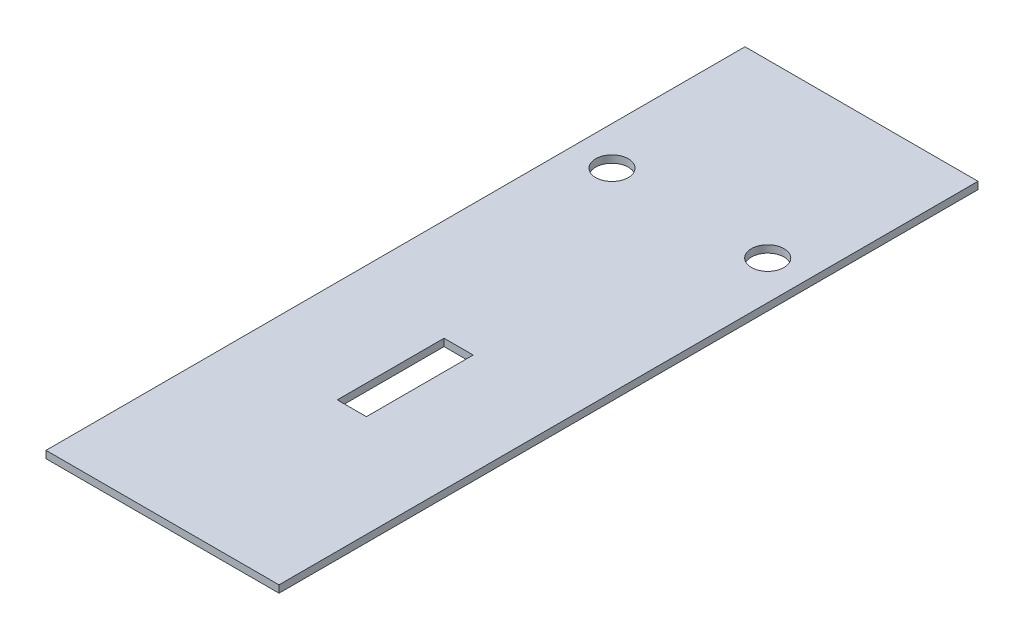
ISO-10303-21;
HEADER;
FILE_DESCRIPTION(('STEP AP214'),'2;1');
FILE_NAME('part.step','',(''),(''),'','','');
FILE_SCHEMA(('AUTOMOTIVE_DESIGN { 1 0 10303 214 1 1 1 1 }'));
ENDSEC;
DATA;
#1=APPLICATION_CONTEXT('core data for automotive mechanical design processes');
#2=APPLICATION_PROTOCOL_DEFINITION('international standard','automotive_design',2000,#1);
#3=PRODUCT_CONTEXT('',#1,'mechanical');
#4=PRODUCT('Part','Part','',(#3));
#5=PRODUCT_RELATED_PRODUCT_CATEGORY('part','',(#4));
#6=PRODUCT_DEFINITION_FORMATION('','',#4);
#7=PRODUCT_DEFINITION_CONTEXT('part definition',#1,'design');
#8=PRODUCT_DEFINITION('design','',#6,#7);
#9=PRODUCT_DEFINITION_SHAPE('','',#8);
#10=(LENGTH_UNIT() NAMED_UNIT(*) SI_UNIT(.MILLI.,.METRE.));
#11=(NAMED_UNIT(*) PLANE_ANGLE_UNIT() SI_UNIT($,.RADIAN.));
#12=(NAMED_UNIT(*) SI_UNIT($,.STERADIAN.) SOLID_ANGLE_UNIT());
#13=UNCERTAINTY_MEASURE_WITH_UNIT(LENGTH_MEASURE(1.E-05),#10,'distance_accuracy_value','');
#14=(GEOMETRIC_REPRESENTATION_CONTEXT(3) GLOBAL_UNCERTAINTY_ASSIGNED_CONTEXT((#13)) GLOBAL_UNIT_ASSIGNED_CONTEXT((#10,
#11,#12)) REPRESENTATION_CONTEXT('',''));
#15=CARTESIAN_POINT('',(0.,0.,0.));
#16=DIRECTION('',(0.,0.,1.));
#17=DIRECTION('',(1.,0.,0.));
#18=AXIS2_PLACEMENT_3D('',#15,#16,#17);
#19=CARTESIAN_POINT('',(76.2,4.7625,228.6));
#20=DIRECTION('',(-1.,0.,0.));
#21=DIRECTION('',(0.,0.,1.));
#22=AXIS2_PLACEMENT_3D('',#19,#20,#21);
#23=PLANE('',#22);
#24=DIRECTION('',(0.,0.,-1.));
#25=VECTOR('',#24,1.);
#26=CARTESIAN_POINT('',(76.2,0.,228.6));
#27=LINE('',#26,#25);
#28=CARTESIAN_POINT('',(76.2,0.,228.6));
#29=VERTEX_POINT('',#28);
#30=CARTESIAN_POINT('',(76.2,0.,-228.6));
#31=VERTEX_POINT('',#30);
#32=EDGE_CURVE('E126',#29,#31,#27,.T.);
#33=ORIENTED_EDGE('',*,*,#32,.T.);
#34=DIRECTION('',(0.,-1.,0.));
#35=VECTOR('',#34,1.);
#36=CARTESIAN_POINT('',(76.2,4.7625,-228.6));
#37=LINE('',#36,#35);
#38=CARTESIAN_POINT('',(76.2,4.7625,-228.6));
#39=VERTEX_POINT('',#38);
#40=EDGE_CURVE('E11',#39,#31,#37,.T.);
#41=ORIENTED_EDGE('',*,*,#40,.F.);
#42=DIRECTION('',(0.,0.,-1.));
#43=VECTOR('',#42,1.);
#44=CARTESIAN_POINT('',(76.2,4.7625,228.6));
#45=LINE('',#44,#43);
#46=CARTESIAN_POINT('',(76.2,4.7625,228.6));
#47=VERTEX_POINT('',#46);
#48=EDGE_CURVE('E174',#47,#39,#45,.T.);
#49=ORIENTED_EDGE('',*,*,#48,.F.);
#50=DIRECTION('',(0.,-1.,0.));
#51=VECTOR('',#50,1.);
#52=CARTESIAN_POINT('',(76.2,4.7625,228.6));
#53=LINE('',#52,#51);
#54=EDGE_CURVE('E188',#47,#29,#53,.T.);
#55=ORIENTED_EDGE('',*,*,#54,.T.);
#56=EDGE_LOOP('',(#33,#41,#49,#55));
#57=FACE_BOUND('',#56,.T.);
#58=ADVANCED_FACE('F43',(#57),#23,.F.);
#59=CARTESIAN_POINT('',(-76.2,4.7625,-228.6));
#60=DIRECTION('',(0.,0.,1.));
#61=DIRECTION('',(1.,0.,0.));
#62=AXIS2_PLACEMENT_3D('',#59,#60,#61);
#63=PLANE('',#62);
#64=DIRECTION('',(-1.,0.,0.));
#65=VECTOR('',#64,1.);
#66=CARTESIAN_POINT('',(-76.2,0.,-228.6));
#67=LINE('',#66,#65);
#68=CARTESIAN_POINT('',(-76.2,0.,-228.6));
#69=VERTEX_POINT('',#68);
#70=EDGE_CURVE('E192',#31,#69,#67,.T.);
#71=ORIENTED_EDGE('',*,*,#70,.T.);
#72=DIRECTION('',(0.,-1.,0.));
#73=VECTOR('',#72,1.);
#74=CARTESIAN_POINT('',(-76.2,4.7625,-228.6));
#75=LINE('',#74,#73);
#76=CARTESIAN_POINT('',(-76.2,4.7625,-228.6));
#77=VERTEX_POINT('',#76);
#78=EDGE_CURVE('E51',#77,#69,#75,.T.);
#79=ORIENTED_EDGE('',*,*,#78,.F.);
#80=DIRECTION('',(-1.,0.,0.));
#81=VECTOR('',#80,1.);
#82=CARTESIAN_POINT('',(-76.2,4.7625,-228.6));
#83=LINE('',#82,#81);
#84=EDGE_CURVE('E178',#39,#77,#83,.T.);
#85=ORIENTED_EDGE('',*,*,#84,.F.);
#86=ORIENTED_EDGE('',*,*,#40,.T.);
#87=EDGE_LOOP('',(#71,#79,#85,#86));
#88=FACE_BOUND('',#87,.T.);
#89=ADVANCED_FACE('F227',(#88),#63,.F.);
#90=CARTESIAN_POINT('',(-76.2,4.7625,228.6));
#91=DIRECTION('',(1.,0.,0.));
#92=DIRECTION('',(0.,0.,-1.));
#93=AXIS2_PLACEMENT_3D('',#90,#91,#92);
#94=PLANE('',#93);
#95=DIRECTION('',(0.,0.,1.));
#96=VECTOR('',#95,1.);
#97=CARTESIAN_POINT('',(-76.2,0.,228.6));
#98=LINE('',#97,#96);
#99=CARTESIAN_POINT('',(-76.2,0.,228.6));
#100=VERTEX_POINT('',#99);
#101=EDGE_CURVE('E195',#69,#100,#98,.T.);
#102=ORIENTED_EDGE('',*,*,#101,.T.);
#103=DIRECTION('',(0.,-1.,0.));
#104=VECTOR('',#103,1.);
#105=CARTESIAN_POINT('',(-76.2,4.7625,228.6));
#106=LINE('',#105,#104);
#107=CARTESIAN_POINT('',(-76.2,4.7625,228.6));
#108=VERTEX_POINT('',#107);
#109=EDGE_CURVE('E203',#108,#100,#106,.T.);
#110=ORIENTED_EDGE('',*,*,#109,.F.);
#111=DIRECTION('',(0.,0.,1.));
#112=VECTOR('',#111,1.);
#113=CARTESIAN_POINT('',(-76.2,4.7625,228.6));
#114=LINE('',#113,#112);
#115=EDGE_CURVE('E182',#77,#108,#114,.T.);
#116=ORIENTED_EDGE('',*,*,#115,.F.);
#117=ORIENTED_EDGE('',*,*,#78,.T.);
#118=EDGE_LOOP('',(#102,#110,#116,#117));
#119=FACE_BOUND('',#118,.T.);
#120=ADVANCED_FACE('F212',(#119),#94,.F.);
#121=CARTESIAN_POINT('',(-76.2,4.7625,228.6));
#122=DIRECTION('',(0.,0.,-1.));
#123=DIRECTION('',(-1.,0.,0.));
#124=AXIS2_PLACEMENT_3D('',#121,#122,#123);
#125=PLANE('',#124);
#126=DIRECTION('',(1.,0.,0.));
#127=VECTOR('',#126,1.);
#128=CARTESIAN_POINT('',(-76.2,0.,228.6));
#129=LINE('',#128,#127);
#130=EDGE_CURVE('E179',#100,#29,#129,.T.);
#131=ORIENTED_EDGE('',*,*,#130,.T.);
#132=ORIENTED_EDGE('',*,*,#54,.F.);
#133=DIRECTION('',(1.,0.,0.));
#134=VECTOR('',#133,1.);
#135=CARTESIAN_POINT('',(-76.2,4.7625,228.6));
#136=LINE('',#135,#134);
#137=EDGE_CURVE('E185',#108,#47,#136,.T.);
#138=ORIENTED_EDGE('',*,*,#137,.F.);
#139=ORIENTED_EDGE('',*,*,#109,.T.);
#140=EDGE_LOOP('',(#131,#132,#138,#139));
#141=FACE_BOUND('',#140,.T.);
#142=ADVANCED_FACE('F221',(#141),#125,.F.);
#143=CARTESIAN_POINT('',(0.,4.7625,0.));
#144=DIRECTION('',(0.,-1.,0.));
#145=DIRECTION('',(0.,0.,-1.));
#146=AXIS2_PLACEMENT_3D('',#143,#144,#145);
#147=PLANE('',#146);
#148=DIRECTION('',(0.,0.,1.));
#149=VECTOR('',#148,1.);
#150=CARTESIAN_POINT('',(-9.525,4.7625,34.9250000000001));
#151=LINE('',#150,#149);
#152=CARTESIAN_POINT('',(-9.525,4.7625,34.9250000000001));
#153=VERTEX_POINT('',#152);
#154=CARTESIAN_POINT('',(-9.52499999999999,4.7625,104.775));
#155=VERTEX_POINT('',#154);
#156=EDGE_CURVE('E108',#153,#155,#151,.T.);
#157=ORIENTED_EDGE('',*,*,#156,.F.);
#158=DIRECTION('',(-1.,0.,0.));
#159=VECTOR('',#158,1.);
#160=CARTESIAN_POINT('',(-9.525,4.7625,34.9250000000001));
#161=LINE('',#160,#159);
#162=CARTESIAN_POINT('',(9.525,4.7625,34.9250000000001));
#163=VERTEX_POINT('',#162);
#164=EDGE_CURVE('E136',#163,#153,#161,.T.);
#165=ORIENTED_EDGE('',*,*,#164,.F.);
#166=DIRECTION('',(0.,0.,-1.));
#167=VECTOR('',#166,1.);
#168=CARTESIAN_POINT('',(9.525,4.7625,34.9250000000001));
#169=LINE('',#168,#167);
#170=CARTESIAN_POINT('',(9.52500000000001,4.7625,104.775));
#171=VERTEX_POINT('',#170);
#172=EDGE_CURVE('E132',#171,#163,#169,.T.);
#173=ORIENTED_EDGE('',*,*,#172,.F.);
#174=DIRECTION('',(1.,0.,0.));
#175=VECTOR('',#174,1.);
#176=CARTESIAN_POINT('',(-9.52499999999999,4.7625,104.775));
#177=LINE('',#176,#175);
#178=EDGE_CURVE('E117',#155,#171,#177,.T.);
#179=ORIENTED_EDGE('',*,*,#178,.F.);
#180=EDGE_LOOP('',(#157,#165,#173,#179));
#181=FACE_BOUND('',#180,.T.);
#182=CARTESIAN_POINT('',(-50.927,4.7625,-116.332));
#183=DIRECTION('',(0.,1.,0.));
#184=DIRECTION('',(0.,0.,1.));
#185=AXIS2_PLACEMENT_3D('',#182,#183,#184);
#186=CIRCLE('',#185,10.668);
#187=CARTESIAN_POINT('',(-50.927,4.7625,-127.));
#188=VERTEX_POINT('',#187);
#189=EDGE_CURVE('E162',#188,#188,#186,.T.);
#190=ORIENTED_EDGE('',*,*,#189,.F.);
#191=EDGE_LOOP('',(#190));
#192=FACE_BOUND('',#191,.T.);
#193=CARTESIAN_POINT('',(50.927,4.7625,-116.332));
#194=DIRECTION('',(0.,1.,0.));
#195=DIRECTION('',(0.,0.,1.));
#196=AXIS2_PLACEMENT_3D('',#193,#194,#195);
#197=CIRCLE('',#196,10.668);
#198=CARTESIAN_POINT('',(50.927,4.7625,-127.));
#199=VERTEX_POINT('',#198);
#200=EDGE_CURVE('E170',#199,#199,#197,.T.);
#201=ORIENTED_EDGE('',*,*,#200,.F.);
#202=EDGE_LOOP('',(#201));
#203=FACE_BOUND('',#202,.T.);
#204=ORIENTED_EDGE('',*,*,#48,.T.);
#205=ORIENTED_EDGE('',*,*,#84,.T.);
#206=ORIENTED_EDGE('',*,*,#115,.T.);
#207=ORIENTED_EDGE('',*,*,#137,.T.);
#208=EDGE_LOOP('',(#204,#205,#206,#207));
#209=FACE_BOUND('',#208,.T.);
#210=ADVANCED_FACE('F130',(#181,#192,#203,#209),#147,.F.);
#211=CARTESIAN_POINT('',(0.,0.,0.));
#212=DIRECTION('',(0.,-1.,0.));
#213=DIRECTION('',(0.,0.,-1.));
#214=AXIS2_PLACEMENT_3D('',#211,#212,#213);
#215=PLANE('',#214);
#216=DIRECTION('',(-1.,0.,0.));
#217=VECTOR('',#216,1.);
#218=CARTESIAN_POINT('',(-9.525,0.,34.9250000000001));
#219=LINE('',#218,#217);
#220=CARTESIAN_POINT('',(9.525,0.,34.9250000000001));
#221=VERTEX_POINT('',#220);
#222=CARTESIAN_POINT('',(-9.525,0.,34.9250000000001));
#223=VERTEX_POINT('',#222);
#224=EDGE_CURVE('E118',#221,#223,#219,.T.);
#225=ORIENTED_EDGE('',*,*,#224,.T.);
#226=DIRECTION('',(0.,0.,1.));
#227=VECTOR('',#226,1.);
#228=CARTESIAN_POINT('',(-9.525,0.,34.9250000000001));
#229=LINE('',#228,#227);
#230=CARTESIAN_POINT('',(-9.52499999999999,0.,104.775));
#231=VERTEX_POINT('',#230);
#232=EDGE_CURVE('E66',#223,#231,#229,.T.);
#233=ORIENTED_EDGE('',*,*,#232,.T.);
#234=DIRECTION('',(1.,0.,0.));
#235=VECTOR('',#234,1.);
#236=CARTESIAN_POINT('',(-9.52499999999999,0.,104.775));
#237=LINE('',#236,#235);
#238=CARTESIAN_POINT('',(9.52500000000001,0.,104.775));
#239=VERTEX_POINT('',#238);
#240=EDGE_CURVE('E124',#231,#239,#237,.T.);
#241=ORIENTED_EDGE('',*,*,#240,.T.);
#242=DIRECTION('',(0.,0.,-1.));
#243=VECTOR('',#242,1.);
#244=CARTESIAN_POINT('',(9.525,0.,34.9250000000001));
#245=LINE('',#244,#243);
#246=EDGE_CURVE('E146',#239,#221,#245,.T.);
#247=ORIENTED_EDGE('',*,*,#246,.T.);
#248=EDGE_LOOP('',(#225,#233,#241,#247));
#249=FACE_BOUND('',#248,.T.);
#250=CARTESIAN_POINT('',(-50.927,0.,-116.332));
#251=DIRECTION('',(0.,1.,0.));
#252=DIRECTION('',(0.,0.,1.));
#253=AXIS2_PLACEMENT_3D('',#250,#251,#252);
#254=CIRCLE('',#253,10.668);
#255=CARTESIAN_POINT('',(-50.927,0.,-127.));
#256=VERTEX_POINT('',#255);
#257=EDGE_CURVE('E143',#256,#256,#254,.T.);
#258=ORIENTED_EDGE('',*,*,#257,.T.);
#259=EDGE_LOOP('',(#258));
#260=FACE_BOUND('',#259,.T.);
#261=CARTESIAN_POINT('',(50.927,0.,-116.332));
#262=DIRECTION('',(0.,1.,0.));
#263=DIRECTION('',(0.,0.,1.));
#264=AXIS2_PLACEMENT_3D('',#261,#262,#263);
#265=CIRCLE('',#264,10.668);
#266=CARTESIAN_POINT('',(50.927,0.,-127.));
#267=VERTEX_POINT('',#266);
#268=EDGE_CURVE('E166',#267,#267,#265,.T.);
#269=ORIENTED_EDGE('',*,*,#268,.T.);
#270=EDGE_LOOP('',(#269));
#271=FACE_BOUND('',#270,.T.);
#272=ORIENTED_EDGE('',*,*,#32,.F.);
#273=ORIENTED_EDGE('',*,*,#130,.F.);
#274=ORIENTED_EDGE('',*,*,#101,.F.);
#275=ORIENTED_EDGE('',*,*,#70,.F.);
#276=EDGE_LOOP('',(#272,#273,#274,#275));
#277=FACE_BOUND('',#276,.T.);
#278=ADVANCED_FACE('F218',(#249,#260,#271,#277),#215,.T.);
#279=CARTESIAN_POINT('',(50.927,4.7625,-116.332));
#280=DIRECTION('',(0.,-1.,0.));
#281=DIRECTION('',(0.,0.,-1.));
#282=AXIS2_PLACEMENT_3D('',#279,#280,#281);
#283=CYLINDRICAL_SURFACE('',#282,10.668);
#284=CARTESIAN_POINT('',(50.927,4.7625,-127.));
#285=CARTESIAN_POINT('',(50.927,4.712890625,-127.));
#286=CARTESIAN_POINT('',(50.927,4.66328125,-127.));
#287=CARTESIAN_POINT('',(50.927,4.5640625,-127.));
#288=CARTESIAN_POINT('',(50.927,4.514453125,-127.));
#289=CARTESIAN_POINT('',(50.927,4.415234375,-127.));
#290=CARTESIAN_POINT('',(50.927,4.365625,-127.));
#291=CARTESIAN_POINT('',(50.927,4.26640625,-127.));
#292=CARTESIAN_POINT('',(50.927,4.216796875,-127.));
#293=CARTESIAN_POINT('',(50.927,4.117578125,-127.));
#294=CARTESIAN_POINT('',(50.927,4.06796875,-127.));
#295=CARTESIAN_POINT('',(50.927,3.96875,-127.));
#296=CARTESIAN_POINT('',(50.927,3.919140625,-127.));
#297=CARTESIAN_POINT('',(50.927,3.819921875,-127.));
#298=CARTESIAN_POINT('',(50.927,3.7703125,-127.));
#299=CARTESIAN_POINT('',(50.927,3.67109375,-127.));
#300=CARTESIAN_POINT('',(50.927,3.621484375,-127.));
#301=CARTESIAN_POINT('',(50.927,3.522265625,-127.));
#302=CARTESIAN_POINT('',(50.927,3.47265625,-127.));
#303=CARTESIAN_POINT('',(50.927,3.3734375,-127.));
#304=CARTESIAN_POINT('',(50.927,3.323828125,-127.));
#305=CARTESIAN_POINT('',(50.927,3.224609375,-127.));
#306=CARTESIAN_POINT('',(50.927,3.175,-127.));
#307=CARTESIAN_POINT('',(50.927,3.07578125,-127.));
#308=CARTESIAN_POINT('',(50.927,3.026171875,-127.));
#309=CARTESIAN_POINT('',(50.927,2.926953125,-127.));
#310=CARTESIAN_POINT('',(50.927,2.87734375,-127.));
#311=CARTESIAN_POINT('',(50.927,2.778125,-127.));
#312=CARTESIAN_POINT('',(50.927,2.728515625,-127.));
#313=CARTESIAN_POINT('',(50.927,2.629296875,-127.));
#314=CARTESIAN_POINT('',(50.927,2.5796875,-127.));
#315=CARTESIAN_POINT('',(50.927,2.48046875,-127.));
#316=CARTESIAN_POINT('',(50.927,2.430859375,-127.));
#317=CARTESIAN_POINT('',(50.927,2.331640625,-127.));
#318=CARTESIAN_POINT('',(50.927,2.28203125,-127.));
#319=CARTESIAN_POINT('',(50.927,2.1828125,-127.));
#320=CARTESIAN_POINT('',(50.927,2.133203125,-127.));
#321=CARTESIAN_POINT('',(50.927,2.033984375,-127.));
#322=CARTESIAN_POINT('',(50.927,1.984375,-127.));
#323=CARTESIAN_POINT('',(50.927,1.88515625,-127.));
#324=CARTESIAN_POINT('',(50.927,1.835546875,-127.));
#325=CARTESIAN_POINT('',(50.927,1.736328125,-127.));
#326=CARTESIAN_POINT('',(50.927,1.68671875,-127.));
#327=CARTESIAN_POINT('',(50.927,1.5875,-127.));
#328=CARTESIAN_POINT('',(50.927,1.537890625,-127.));
#329=CARTESIAN_POINT('',(50.927,1.438671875,-127.));
#330=CARTESIAN_POINT('',(50.927,1.3890625,-127.));
#331=CARTESIAN_POINT('',(50.927,1.28984375,-127.));
#332=CARTESIAN_POINT('',(50.927,1.240234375,-127.));
#333=CARTESIAN_POINT('',(50.927,1.141015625,-127.));
#334=CARTESIAN_POINT('',(50.927,1.09140625,-127.));
#335=CARTESIAN_POINT('',(50.927,0.992187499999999,-127.));
#336=CARTESIAN_POINT('',(50.927,0.942578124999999,-127.));
#337=CARTESIAN_POINT('',(50.927,0.843359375,-127.));
#338=CARTESIAN_POINT('',(50.927,0.79375,-127.));
#339=CARTESIAN_POINT('',(50.927,0.69453125,-127.));
#340=CARTESIAN_POINT('',(50.927,0.644921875,-127.));
#341=CARTESIAN_POINT('',(50.927,0.545703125,-127.));
#342=CARTESIAN_POINT('',(50.927,0.49609375,-127.));
#343=CARTESIAN_POINT('',(50.927,0.396875,-127.));
#344=CARTESIAN_POINT('',(50.927,0.347265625,-127.));
#345=CARTESIAN_POINT('',(50.927,0.248046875,-127.));
#346=CARTESIAN_POINT('',(50.927,0.1984375,-127.));
#347=CARTESIAN_POINT('',(50.927,0.09921875,-127.));
#348=CARTESIAN_POINT('',(50.927,0.049609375,-127.));
#349=CARTESIAN_POINT('',(50.927,0.,-127.));
#350=B_SPLINE_CURVE_WITH_KNOTS('',3,(#284,#285,#286,#287,#288,#289,#290,#291,#292,#293,#294,
#295,#296,#297,#298,#299,#300,#301,#302,#303,#304,#305,#306,#307,#308,#309,#310,#311,#312,#313,
#314,#315,#316,#317,#318,#319,#320,#321,#322,#323,#324,#325,#326,#327,#328,#329,#330,#331,#332,
#333,#334,#335,#336,#337,#338,#339,#340,#341,#342,#343,#344,#345,#346,#347,#348,#349),
.UNSPECIFIED.,.F.,.F.,(4,2,2,2,2,2,2,2,2,2,2,2,2,2,2,2,2,2,2,2,2,2,2,2,2,2,2,2,2,2,2,2,4),(0.,
0.148828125,0.29765625,0.446484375,0.5953125,0.744140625,0.892968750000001,1.041796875,1.190625,
1.339453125,1.48828125,1.637109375,1.7859375,1.934765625,2.08359375,2.232421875,2.38125,
2.530078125,2.67890625,2.827734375,2.9765625,3.125390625,3.27421875,3.423046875,3.571875,
3.720703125,3.86953125,4.018359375,4.1671875,4.316015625,4.46484375,4.613671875,4.7625),.UNSPECIFIED.);
#351=EDGE_CURVE('BSEAM239',#199,#267,#350,.T.);
#352=ORIENTED_EDGE('',*,*,#200,.T.);
#353=ORIENTED_EDGE('',*,*,#268,.F.);
#354=ORIENTED_EDGE('',*,*,#351,.T.);
#355=ORIENTED_EDGE('',*,*,#351,.F.);
#356=EDGE_LOOP('',(#352,#354,#353,#355));
#357=FACE_BOUND('',#356,.T.);
#358=ADVANCED_FACE('F239',(#357),#283,.F.);
#359=CARTESIAN_POINT('',(-50.927,4.7625,-116.332));
#360=DIRECTION('',(0.,-1.,0.));
#361=DIRECTION('',(0.,0.,-1.));
#362=AXIS2_PLACEMENT_3D('',#359,#360,#361);
#363=CYLINDRICAL_SURFACE('',#362,10.668);
#364=CARTESIAN_POINT('',(-50.927,4.7625,-127.));
#365=CARTESIAN_POINT('',(-50.927,4.712890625,-127.));
#366=CARTESIAN_POINT('',(-50.927,4.66328125,-127.));
#367=CARTESIAN_POINT('',(-50.927,4.5640625,-127.));
#368=CARTESIAN_POINT('',(-50.927,4.514453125,-127.));
#369=CARTESIAN_POINT('',(-50.927,4.415234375,-127.));
#370=CARTESIAN_POINT('',(-50.927,4.365625,-127.));
#371=CARTESIAN_POINT('',(-50.927,4.26640625,-127.));
#372=CARTESIAN_POINT('',(-50.927,4.216796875,-127.));
#373=CARTESIAN_POINT('',(-50.927,4.117578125,-127.));
#374=CARTESIAN_POINT('',(-50.927,4.06796875,-127.));
#375=CARTESIAN_POINT('',(-50.927,3.96875,-127.));
#376=CARTESIAN_POINT('',(-50.927,3.919140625,-127.));
#377=CARTESIAN_POINT('',(-50.927,3.819921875,-127.));
#378=CARTESIAN_POINT('',(-50.927,3.7703125,-127.));
#379=CARTESIAN_POINT('',(-50.927,3.67109375,-127.));
#380=CARTESIAN_POINT('',(-50.927,3.621484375,-127.));
#381=CARTESIAN_POINT('',(-50.927,3.522265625,-127.));
#382=CARTESIAN_POINT('',(-50.927,3.47265625,-127.));
#383=CARTESIAN_POINT('',(-50.927,3.3734375,-127.));
#384=CARTESIAN_POINT('',(-50.927,3.323828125,-127.));
#385=CARTESIAN_POINT('',(-50.927,3.224609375,-127.));
#386=CARTESIAN_POINT('',(-50.927,3.175,-127.));
#387=CARTESIAN_POINT('',(-50.927,3.07578125,-127.));
#388=CARTESIAN_POINT('',(-50.927,3.026171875,-127.));
#389=CARTESIAN_POINT('',(-50.927,2.926953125,-127.));
#390=CARTESIAN_POINT('',(-50.927,2.87734375,-127.));
#391=CARTESIAN_POINT('',(-50.927,2.778125,-127.));
#392=CARTESIAN_POINT('',(-50.927,2.728515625,-127.));
#393=CARTESIAN_POINT('',(-50.927,2.629296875,-127.));
#394=CARTESIAN_POINT('',(-50.927,2.5796875,-127.));
#395=CARTESIAN_POINT('',(-50.927,2.48046875,-127.));
#396=CARTESIAN_POINT('',(-50.927,2.430859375,-127.));
#397=CARTESIAN_POINT('',(-50.927,2.331640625,-127.));
#398=CARTESIAN_POINT('',(-50.927,2.28203125,-127.));
#399=CARTESIAN_POINT('',(-50.927,2.1828125,-127.));
#400=CARTESIAN_POINT('',(-50.927,2.133203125,-127.));
#401=CARTESIAN_POINT('',(-50.927,2.033984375,-127.));
#402=CARTESIAN_POINT('',(-50.927,1.984375,-127.));
#403=CARTESIAN_POINT('',(-50.927,1.88515625,-127.));
#404=CARTESIAN_POINT('',(-50.927,1.835546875,-127.));
#405=CARTESIAN_POINT('',(-50.927,1.736328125,-127.));
#406=CARTESIAN_POINT('',(-50.927,1.68671875,-127.));
#407=CARTESIAN_POINT('',(-50.927,1.5875,-127.));
#408=CARTESIAN_POINT('',(-50.927,1.537890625,-127.));
#409=CARTESIAN_POINT('',(-50.927,1.438671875,-127.));
#410=CARTESIAN_POINT('',(-50.927,1.3890625,-127.));
#411=CARTESIAN_POINT('',(-50.927,1.28984375,-127.));
#412=CARTESIAN_POINT('',(-50.927,1.240234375,-127.));
#413=CARTESIAN_POINT('',(-50.927,1.141015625,-127.));
#414=CARTESIAN_POINT('',(-50.927,1.09140625,-127.));
#415=CARTESIAN_POINT('',(-50.927,0.992187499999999,-127.));
#416=CARTESIAN_POINT('',(-50.927,0.942578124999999,-127.));
#417=CARTESIAN_POINT('',(-50.927,0.843359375,-127.));
#418=CARTESIAN_POINT('',(-50.927,0.79375,-127.));
#419=CARTESIAN_POINT('',(-50.927,0.69453125,-127.));
#420=CARTESIAN_POINT('',(-50.927,0.644921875,-127.));
#421=CARTESIAN_POINT('',(-50.927,0.545703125,-127.));
#422=CARTESIAN_POINT('',(-50.927,0.49609375,-127.));
#423=CARTESIAN_POINT('',(-50.927,0.396875,-127.));
#424=CARTESIAN_POINT('',(-50.927,0.347265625,-127.));
#425=CARTESIAN_POINT('',(-50.927,0.248046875,-127.));
#426=CARTESIAN_POINT('',(-50.927,0.1984375,-127.));
#427=CARTESIAN_POINT('',(-50.927,0.09921875,-127.));
#428=CARTESIAN_POINT('',(-50.927,0.049609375,-127.));
#429=CARTESIAN_POINT('',(-50.927,0.,-127.));
#430=B_SPLINE_CURVE_WITH_KNOTS('',3,(#364,#365,#366,#367,#368,#369,#370,#371,#372,#373,#374,
#375,#376,#377,#378,#379,#380,#381,#382,#383,#384,#385,#386,#387,#388,#389,#390,#391,#392,#393,
#394,#395,#396,#397,#398,#399,#400,#401,#402,#403,#404,#405,#406,#407,#408,#409,#410,#411,#412,
#413,#414,#415,#416,#417,#418,#419,#420,#421,#422,#423,#424,#425,#426,#427,#428,#429),
.UNSPECIFIED.,.F.,.F.,(4,2,2,2,2,2,2,2,2,2,2,2,2,2,2,2,2,2,2,2,2,2,2,2,2,2,2,2,2,2,2,2,4),(0.,
0.148828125,0.29765625,0.446484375,0.5953125,0.744140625,0.892968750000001,1.041796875,1.190625,
1.339453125,1.48828125,1.637109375,1.7859375,1.934765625,2.08359375,2.232421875,2.38125,
2.530078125,2.67890625,2.827734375,2.9765625,3.125390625,3.27421875,3.423046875,3.571875,
3.720703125,3.86953125,4.018359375,4.1671875,4.316015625,4.46484375,4.613671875,4.7625),.UNSPECIFIED.);
#431=EDGE_CURVE('BSEAM245',#188,#256,#430,.T.);
#432=ORIENTED_EDGE('',*,*,#189,.T.);
#433=ORIENTED_EDGE('',*,*,#257,.F.);
#434=ORIENTED_EDGE('',*,*,#431,.T.);
#435=ORIENTED_EDGE('',*,*,#431,.F.);
#436=EDGE_LOOP('',(#432,#434,#433,#435));
#437=FACE_BOUND('',#436,.T.);
#438=ADVANCED_FACE('F245',(#437),#363,.F.);
#439=CARTESIAN_POINT('',(-9.525,4.7625,34.9250000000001));
#440=DIRECTION('',(1.,0.,0.));
#441=DIRECTION('',(0.,0.,-1.));
#442=AXIS2_PLACEMENT_3D('',#439,#440,#441);
#443=PLANE('',#442);
#444=ORIENTED_EDGE('',*,*,#232,.F.);
#445=DIRECTION('',(0.,-1.,0.));
#446=VECTOR('',#445,1.);
#447=CARTESIAN_POINT('',(-9.525,4.7625,34.9250000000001));
#448=LINE('',#447,#446);
#449=EDGE_CURVE('E112',#153,#223,#448,.T.);
#450=ORIENTED_EDGE('',*,*,#449,.F.);
#451=ORIENTED_EDGE('',*,*,#156,.T.);
#452=DIRECTION('',(0.,-1.,0.));
#453=VECTOR('',#452,1.);
#454=CARTESIAN_POINT('',(-9.52499999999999,4.7625,104.775));
#455=LINE('',#454,#453);
#456=EDGE_CURVE('E111',#155,#231,#455,.T.);
#457=ORIENTED_EDGE('',*,*,#456,.T.);
#458=EDGE_LOOP('',(#444,#450,#451,#457));
#459=FACE_BOUND('',#458,.T.);
#460=ADVANCED_FACE('F110',(#459),#443,.T.);
#461=CARTESIAN_POINT('',(-9.52499999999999,4.7625,104.775));
#462=DIRECTION('',(0.,0.,-1.));
#463=DIRECTION('',(-1.,0.,0.));
#464=AXIS2_PLACEMENT_3D('',#461,#462,#463);
#465=PLANE('',#464);
#466=ORIENTED_EDGE('',*,*,#240,.F.);
#467=ORIENTED_EDGE('',*,*,#456,.F.);
#468=ORIENTED_EDGE('',*,*,#178,.T.);
#469=DIRECTION('',(0.,-1.,0.));
#470=VECTOR('',#469,1.);
#471=CARTESIAN_POINT('',(9.52500000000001,4.7625,104.775));
#472=LINE('',#471,#470);
#473=EDGE_CURVE('E127',#171,#239,#472,.T.);
#474=ORIENTED_EDGE('',*,*,#473,.T.);
#475=EDGE_LOOP('',(#466,#467,#468,#474));
#476=FACE_BOUND('',#475,.T.);
#477=ADVANCED_FACE('F121',(#476),#465,.T.);
#478=CARTESIAN_POINT('',(9.525,4.7625,34.9250000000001));
#479=DIRECTION('',(-1.,0.,0.));
#480=DIRECTION('',(0.,0.,1.));
#481=AXIS2_PLACEMENT_3D('',#478,#479,#480);
#482=PLANE('',#481);
#483=ORIENTED_EDGE('',*,*,#246,.F.);
#484=ORIENTED_EDGE('',*,*,#473,.F.);
#485=ORIENTED_EDGE('',*,*,#172,.T.);
#486=DIRECTION('',(0.,-1.,0.));
#487=VECTOR('',#486,1.);
#488=CARTESIAN_POINT('',(9.525,4.7625,34.9250000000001));
#489=LINE('',#488,#487);
#490=EDGE_CURVE('E58',#163,#221,#489,.T.);
#491=ORIENTED_EDGE('',*,*,#490,.T.);
#492=EDGE_LOOP('',(#483,#484,#485,#491));
#493=FACE_BOUND('',#492,.T.);
#494=ADVANCED_FACE('F254',(#493),#482,.T.);
#495=CARTESIAN_POINT('',(-9.525,4.7625,34.9250000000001));
#496=DIRECTION('',(0.,0.,1.));
#497=DIRECTION('',(1.,0.,0.));
#498=AXIS2_PLACEMENT_3D('',#495,#496,#497);
#499=PLANE('',#498);
#500=ORIENTED_EDGE('',*,*,#224,.F.);
#501=ORIENTED_EDGE('',*,*,#490,.F.);
#502=ORIENTED_EDGE('',*,*,#164,.T.);
#503=ORIENTED_EDGE('',*,*,#449,.T.);
#504=EDGE_LOOP('',(#500,#501,#502,#503));
#505=FACE_BOUND('',#504,.T.);
#506=ADVANCED_FACE('F257',(#505),#499,.T.);
#507=CLOSED_SHELL('',(#58,#89,#120,#142,#210,#278,#358,#438,#460,#477,#494,#506));
#508=MANIFOLD_SOLID_BREP('B2',#507);
#509=ADVANCED_BREP_SHAPE_REPRESENTATION('',(#18,#508),#14);
#510=SHAPE_DEFINITION_REPRESENTATION(#9,#509);
ENDSEC;
END-ISO-10303-21;
